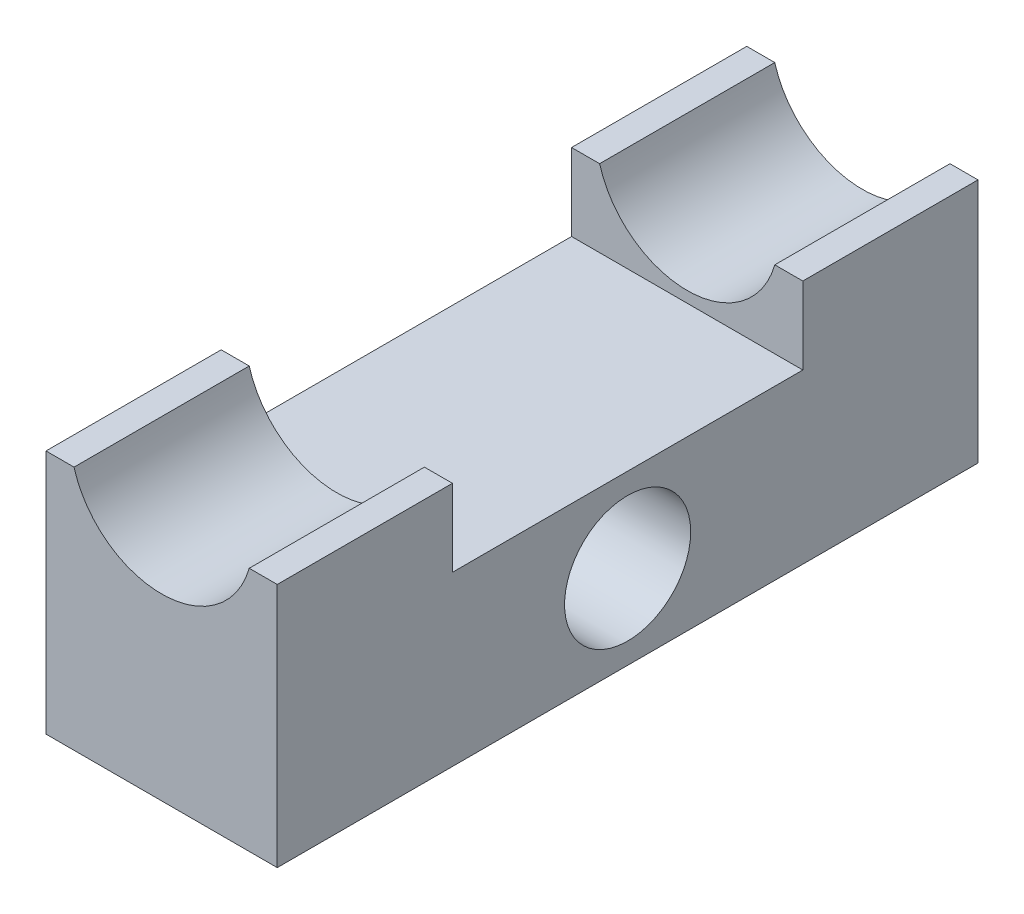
from build123d import *

# Parameters (mm, degrees)
BOSS_EXTRU_1_DEPTH      = 100
ESQUISSE2_R             = 9
ESQUISSE2_W             = 50
ESQUISSE2_H             = 11
ENL_V_MAT_EXTRU_1_DEPTH = 100


with BuildPart() as part:
    # Esquisse1 → Boss.-Extru.1 (new body)
    with BuildSketch(Plane.XY):
        with BuildLine():
            Line((1007.5, 388.72850594), (1003.5, 388.72850594))
            Line((1003.5, 388.72850594), (1003.5, 353.72850594))
            Line((1003.5, 353.72850594), (1036.5, 353.72850594))
            Line((1036.5, 353.72850594), (1036.5, 388.72850594))
            Line((1036.5, 388.72850594), (1032.5, 388.72850594))
            ThreePointArc((1032.5, 388.72850594), (1020, 379.299220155), (1007.5, 388.72850594))
        make_face()
    extrude(amount=BOSS_EXTRU_1_DEPTH)

    # Esquisse2 → Enl_v. mat.-Extru.1 (cut)
    with BuildSketch(Plane(origin=(1036.5, 0, 0), x_dir=(0, 0, -1), z_dir=(1, 0, 0))):
        with Locations((-50, 365.72850594)):
            Circle(ESQUISSE2_R)
        with Locations((-50, 383.22850594)):
            Rectangle(ESQUISSE2_W, ESQUISSE2_H)
    extrude(amount=-ENL_V_MAT_EXTRU_1_DEPTH, mode=Mode.SUBTRACT)


solid = part.part
